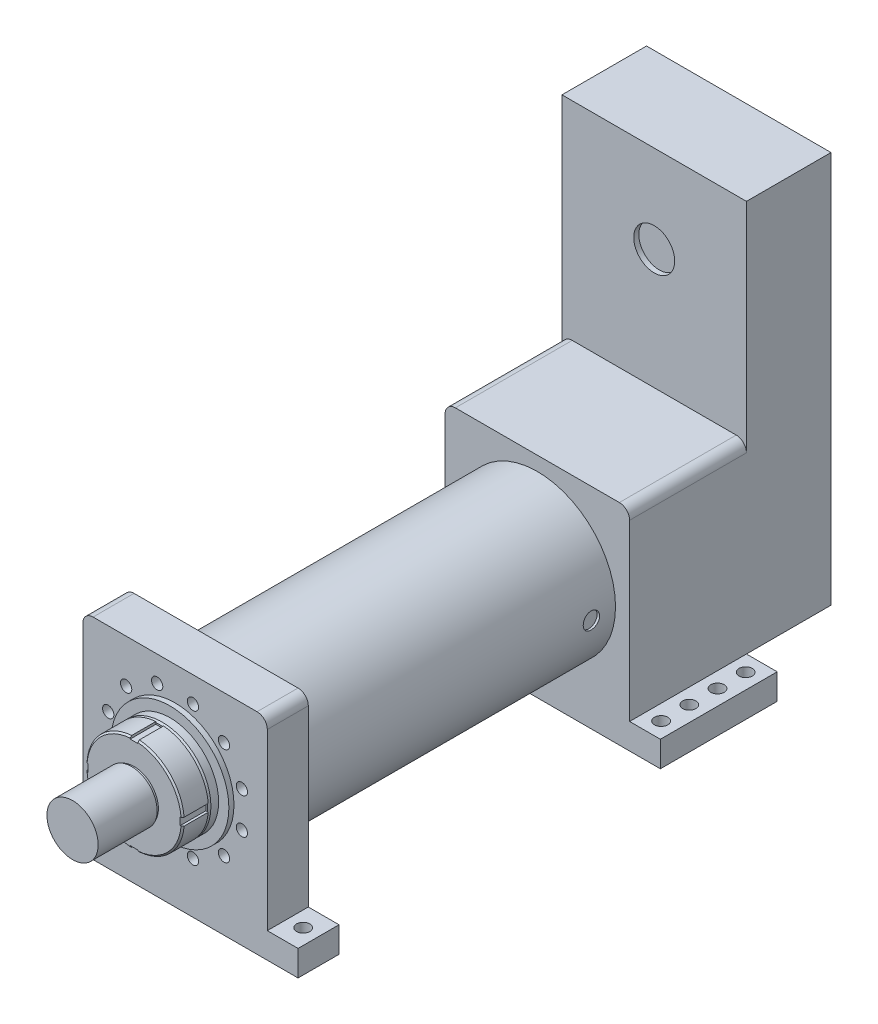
from build123d import *

# Parameters (mm, degrees)
SKETCH_1_R          = 152.5
EXTRUDE_1_DEPTH     = 627
SKETCH_2_W          = 360
SKETCH_2_H          = 360
SKETCH_2_R          = 11
EXTRUDE_2_DEPTH     = 80
SKETCH_11_W         = 360
SKETCH_11_H         = 360
EXTRUDE_10_DEPTH    = 50
SKETCH_21_W         = 360
SKETCH_21_H         = 360
EXTRUDE_14_DEPTH    = 178
SKETCH_22_W         = 360
SKETCH_22_H         = 765
EXTRUDE_16_DEPTH    = 165
SKETCH_23_R         = 40
CUT_EXTRUDE_5_DEPTH = 10
SKETCH_16_R         = 16
CUT_EXTRUDE_6_DEPTH = 5
SKETCH_14_R         = 16
CUT_EXTRUDE_7_DEPTH = 5
SKETCH_26_R         = 115
EXTRUDE_21_DEPTH    = 10
SKETCH_27_R         = 95
EXTRUDE_22_DEPTH    = 20
CHAMFER_1_SIZE      = 5
CHAMFER_1_SIZE2     = 1.819851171
EXTRUDE_23_DEPTH    = 50
SKETCH_29_R         = 47.5
EXTRUDE_24_DEPTH    = 5
SKETCH_30_R         = 50
EXTRUDE_25_DEPTH    = 115
CHAMFER_2_SIZE      = 3
SKETCH_31_W         = 480
SKETCH_31_H         = 228
SKETCH_31_R         = 13
SKETCH_31_H_2       = 80
EXTRUDE_28_DEPTH    = 50
FILLET_4_R          = 20


with BuildPart() as part:
    # Sketch 1 → Extrude 1 (new body)
    with BuildSketch(Plane.XY):
        Circle(SKETCH_1_R)
    extrude(amount=EXTRUDE_1_DEPTH)

    # Sketch 2 → Extrude 2 (add)
    with BuildSketch(Plane.XY.offset(627)):
        Rectangle(SKETCH_2_W, SKETCH_2_H)
        with Locations((130.399986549, 34.940571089)):
            Circle(SKETCH_2_R, mode=Mode.SUBTRACT)
        with Locations((130.399986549, -34.940571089)):
            Circle(SKETCH_2_R, mode=Mode.SUBTRACT)
        with Locations((95.45941546, -95.45941546)):
            Circle(SKETCH_2_R, mode=Mode.SUBTRACT)
        with Locations((34.940571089, -130.399986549)):
            Circle(SKETCH_2_R, mode=Mode.SUBTRACT)
        with Locations((-34.940571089, -130.399986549)):
            Circle(SKETCH_2_R, mode=Mode.SUBTRACT)
        with Locations((-95.45941546, -95.45941546)):
            Circle(SKETCH_2_R, mode=Mode.SUBTRACT)
        with Locations((-130.399986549, -34.940571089)):
            Circle(SKETCH_2_R, mode=Mode.SUBTRACT)
        with Locations((-130.399986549, 34.940571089)):
            Circle(SKETCH_2_R, mode=Mode.SUBTRACT)
        with Locations((-95.45941546, 95.45941546)):
            Circle(SKETCH_2_R, mode=Mode.SUBTRACT)
        with Locations((-34.940571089, 130.399986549)):
            Circle(SKETCH_2_R, mode=Mode.SUBTRACT)
        with Locations((34.940571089, 130.399986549)):
            Circle(SKETCH_2_R, mode=Mode.SUBTRACT)
        with Locations((95.45941546, 95.45941546)):
            Circle(SKETCH_2_R, mode=Mode.SUBTRACT)
    extrude(amount=EXTRUDE_2_DEPTH)

    # Sketch 11 → Extrude 10 (add)
    with BuildSketch(Plane(origin=(0, 0, 0), x_dir=(-1, 0, 0), z_dir=(0, 0, -1))):
        Rectangle(SKETCH_11_W, SKETCH_11_H)
    extrude(amount=EXTRUDE_10_DEPTH)

    # Sketch 16 → Cut-Extrude 6 (cut)
    with BuildSketch(Plane(origin=(-152.5, 0, 0), x_dir=(0, 0, -1), z_dir=(1, 0, 0))):
        with Locations(Location((-27, 0, 0), (0, 0, 180))):
            Circle(SKETCH_16_R)
        with Locations(Location((-551.5, 0, 0), (0, 0, 180))):
            Circle(SKETCH_16_R)
    extrude(amount=CUT_EXTRUDE_6_DEPTH, mode=Mode.SUBTRACT)

    # Sketch 14 → Cut-Extrude 7 (cut)
    with BuildSketch(Plane(origin=(152.5, 0, 0), x_dir=(0, 0, -1), z_dir=(1, 0, 0))):
        with Locations((-47, 0)):
            Circle(SKETCH_14_R)
    extrude(amount=-CUT_EXTRUDE_7_DEPTH, mode=Mode.SUBTRACT)

    # Sketch 26 → Extrude 21 (add)
    with BuildSketch(Plane.XY.offset(707)):
        Circle(SKETCH_26_R)
    extrude(amount=EXTRUDE_21_DEPTH)



with BuildPart() as body_2:
    # Sketch 21 → Extrude 14 (new body)
    with BuildSketch(Plane(origin=(0, 0, -50), x_dir=(-1, 0, 0), z_dir=(0, 0, -1))):
        Rectangle(SKETCH_21_W, SKETCH_21_H)
    extrude(amount=EXTRUDE_14_DEPTH)


with BuildPart() as body_3:
    # Sketch 22 → Extrude 16 (new body)
    with BuildSketch(Plane(origin=(0, 0, -228), x_dir=(-1, 0, 0), z_dir=(0, 0, -1))):
        with Locations((0, 202.5)):
            Rectangle(SKETCH_22_W, SKETCH_22_H)
    extrude(amount=EXTRUDE_16_DEPTH)

    # Sketch 23 → Cut-Extrude 5 (cut)
    with BuildSketch(Plane.XY.offset(-228)):
        with Locations((0, 414)):
            Circle(SKETCH_23_R)
    extrude(amount=-CUT_EXTRUDE_5_DEPTH, mode=Mode.SUBTRACT)


with BuildPart() as body_4:
    # Sketch 27 → Extrude 22 (new body)
    with BuildSketch(Plane.XY.offset(717)):
        Circle(SKETCH_27_R)
    extrude(amount=EXTRUDE_22_DEPTH)

    # Chamfer 1
    chamfer_1_edges = [body_4.edges().sort_by_distance(p)[0] for p in [
        (-95, 0, 737),
    ]]
    chamfer_1_side = [body_4.faces().sort_by_distance(p)[0] for p in [
        (-95, 0, 727),
    ]]
    chamfer(chamfer_1_edges, length=CHAMFER_1_SIZE, length2=CHAMFER_1_SIZE2, reference=chamfer_1_side[0])

    # Sketch 28 → Extrude 23 (add)
    with BuildSketch(Plane.XY.offset(737)):
        with BuildLine():
            Line((-7.5, 90), (7.5, 90))
            Line((7.5, 90), (7.5, 94.703484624))
            ThreePointArc((7.5, 94.703484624), (67.175144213, 67.175144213), (94.703484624, 7.5))
            Line((94.703484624, 7.5), (90, 7.5))
            Line((90, 7.5), (90, -7.5))
            Line((90, -7.5), (94.703484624, -7.5))
            ThreePointArc((94.703484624, -7.5), (67.175144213, -67.175144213), (7.5, -94.703484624))
            Line((7.5, -94.703484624), (7.5, -90))
            Line((7.5, -90), (-7.5, -90))
            Line((-7.5, -90), (-7.5, -94.703484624))
            ThreePointArc((-7.5, -94.703484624), (-67.175144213, -67.175144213), (-94.703484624, -7.5))
            Line((-94.703484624, -7.5), (-90, -7.5))
            Line((-90, -7.5), (-90, 7.5))
            Line((-90, 7.5), (-94.703484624, 7.5))
            ThreePointArc((-94.703484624, 7.5), (-67.175144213, 67.175144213), (-7.5, 94.703484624))
            Line((-7.5, 94.703484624), (-7.5, 90))
        make_face()
    extrude(amount=EXTRUDE_23_DEPTH)

    # Sketch 29 → Extrude 24 (add)
    with BuildSketch(Plane.XY.offset(787)):
        Circle(SKETCH_29_R)
    extrude(amount=EXTRUDE_24_DEPTH)

    # Sketch 30 → Extrude 25 (add)
    with BuildSketch(Plane.XY.offset(792)):
        Circle(SKETCH_30_R)
    extrude(amount=EXTRUDE_25_DEPTH)

    # Chamfer 2
    chamfer_2_edges = [body_4.edges().sort_by_distance(p)[0] for p in [
        (-67.175144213, -67.175144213, 787),
        (67.175144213, -67.175144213, 787),
        (67.175144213, 67.175144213, 787),
        (-67.175144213, 67.175144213, 787),
    ]]
    chamfer(chamfer_2_edges, length=CHAMFER_2_SIZE)


with BuildPart() as part_1:
    add(part.part)

    add(body_2.part)  # Extrude 28 merges body 2

    add(body_3.part)  # Extrude 28 merges body 3
    # Sketch 31 → Extrude 28 (add)
    # profile 1 of 2: a face of its own
    with BuildSketch(Plane.XZ.offset(180)):
        with Locations((0, -114)):
            Rectangle(SKETCH_31_W, SKETCH_31_H)
        with Locations(Location((-210, -196.5, 0), (0, 0, 270))):
            Circle(SKETCH_31_R, mode=Mode.SUBTRACT)
        with Locations(Location((-210, -141.5, 0), (0, 0, 270))):
            Circle(SKETCH_31_R, mode=Mode.SUBTRACT)
        with Locations(Location((-210, -86.5, 0), (0, 0, 270))):
            Circle(SKETCH_31_R, mode=Mode.SUBTRACT)
        with Locations(Location((-210, -31.5, 0), (0, 0, 270))):
            Circle(SKETCH_31_R, mode=Mode.SUBTRACT)
        with Locations(Location((210, -31.5, 0), (0, 0, 90))):
            Circle(SKETCH_31_R, mode=Mode.SUBTRACT)
        with Locations(Location((210, -86.5, 0), (0, 0, 90))):
            Circle(SKETCH_31_R, mode=Mode.SUBTRACT)
        with Locations(Location((210, -141.5, 0), (0, 0, 90))):
            Circle(SKETCH_31_R, mode=Mode.SUBTRACT)
        with Locations(Location((210, -196.5, 0), (0, 0, 90))):
            Circle(SKETCH_31_R, mode=Mode.SUBTRACT)
    # profile 2 of 2: a face of its own
    with BuildSketch(Plane.XZ.offset(180)):
        with Locations((0, 667)):
            Rectangle(SKETCH_31_W, SKETCH_31_H_2)
        with Locations(Location((-210, 667, 0), (0, 0, 270))):
            Circle(SKETCH_31_R, mode=Mode.SUBTRACT)
        with Locations(Location((210, 667, 0), (0, 0, 90))):
            Circle(SKETCH_31_R, mode=Mode.SUBTRACT)
    extrude(amount=EXTRUDE_28_DEPTH)

    # Fillet 4
    fillet_4_edges = [part_1.edges().sort_by_distance(p)[0] for p in [
        (180, 180, 667),
        (-180, 180, 667),
        (180, 180, -114),
        (-180, 180, -114),
    ]]
    fillet(fillet_4_edges, radius=FILLET_4_R)


solid = Compound([body_4.part, part_1.part])
